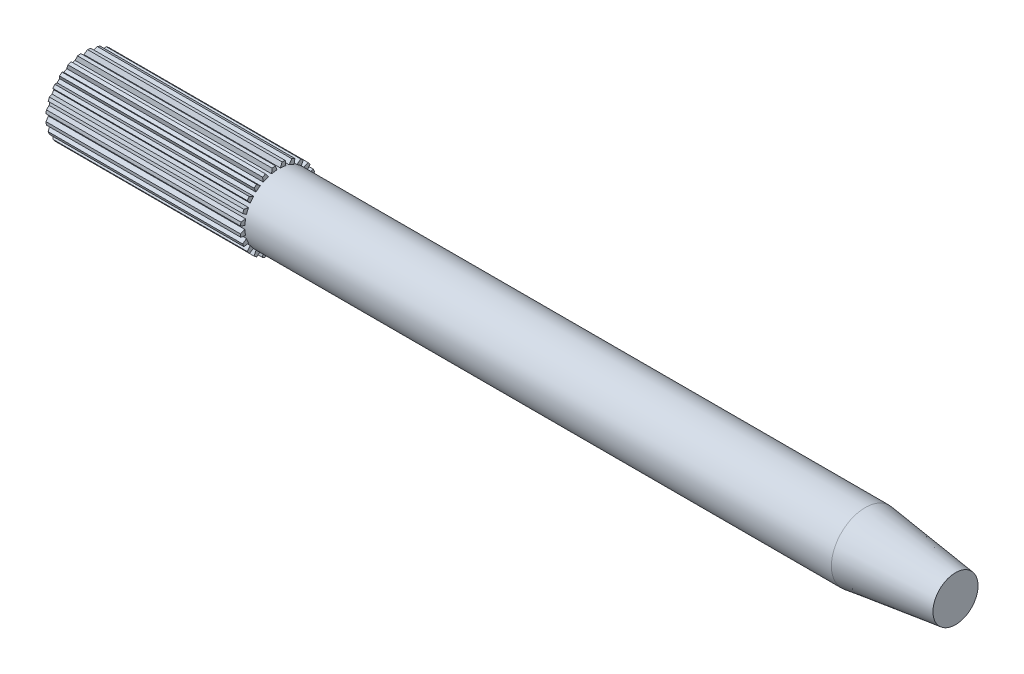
from build123d import *

# Parameters (mm, degrees)
ENL_V_START                  = -10
ENL_V_MAT_EXTRU_1_DEPTH      = 10
R_P_TITION_CIRCULAIRE1_COUNT = 24


with BuildPart() as part:
    # Esquisse1 → Base-R_volution (revolve)
    with BuildSketch(Plane.XY, mode=Mode.PRIVATE) as base_r_volution_sk:
        with BuildLine():
            Line((0, 0), (39, 0))
            Line((39, 0), (39, 1))
            Line((39, 1), (35, 1.5))
            Line((35, 1.5), (9, 1.5))
            Line((9, 1.5), (9, 1.7))
            Line((9, 1.7), (0.379226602, 1.7))
            ThreePointArc((0.379226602, 1.7), (0.095957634, 0.870892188), (0, 0))
        make_face()
    revolve(base_r_volution_sk.sketch.rotate(Axis((-5, 0, 0), (1, 0, 0)), 90), axis=Axis((-5, 0, 0), (1, 0, 0)))

    # Esquisse2 → Enl_v. mat.-Extru.1 (cut)
    with BuildSketch(Plane(origin=(9, 0, 0), x_dir=(0, 0, -1), z_dir=(1, 0, 0)).offset(ENL_V_START)):
        with BuildLine():
            Line((0.15, 1.693369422), (0.075, 1.498123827))
            ThreePointArc((0.075, 1.498123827), (0, 1.5), (-0.075, 1.498123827))
            Line((-0.075, 1.498123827), (-0.15, 1.693369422))
            ThreePointArc((-0.15, 1.693369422), (0, 1.7), (0.15, 1.693369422))
        make_face()
    enl_v_mat_extru_1 = extrude(amount=ENL_V_MAT_EXTRU_1_DEPTH, mode=Mode.SUBTRACT)

    # R_p_tition circulaire1: Enl_v. mat.-Extru.1 ×24 about axis
    r_p_tition_circulaire1_axis = Axis((45, 0, 0), (-1, 0, 0))
    for i in range(1, R_P_TITION_CIRCULAIRE1_COUNT):
        add(enl_v_mat_extru_1.rotate(r_p_tition_circulaire1_axis, i * 360 / R_P_TITION_CIRCULAIRE1_COUNT), mode=Mode.SUBTRACT)


solid = part.part
